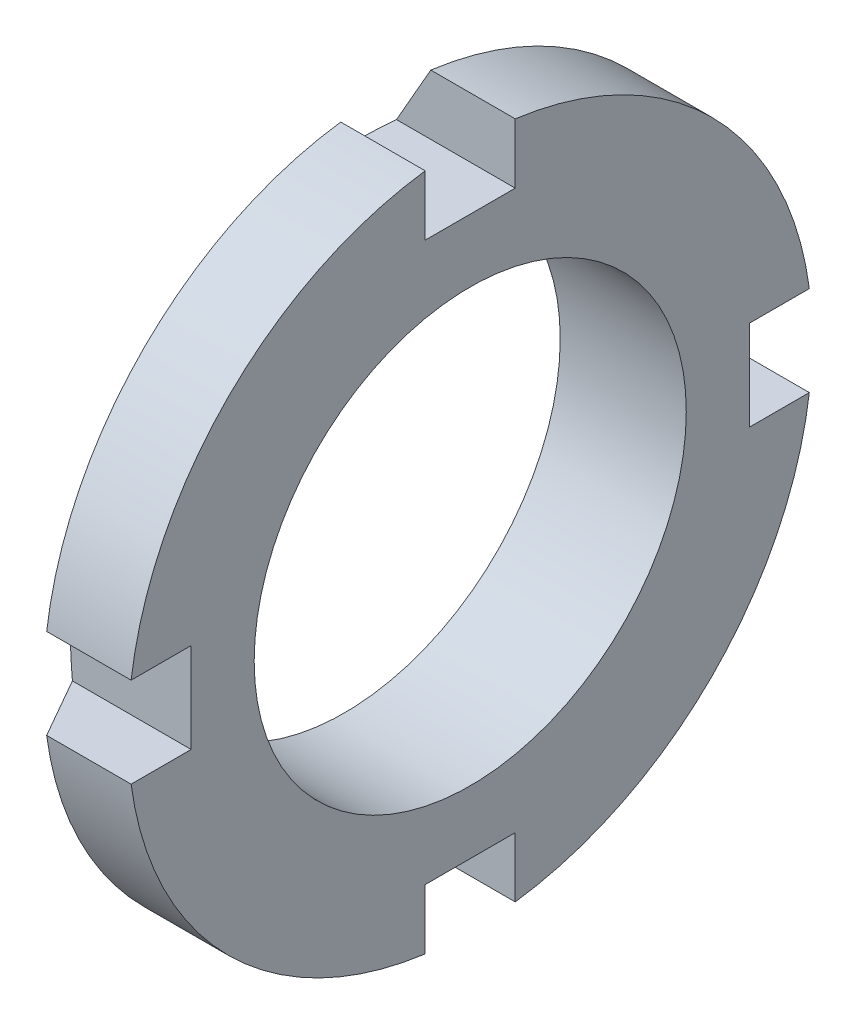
from build123d import *

# Parameters (mm, degrees)
ESQUISSE2_W                  = 5
ESQUISSE2_H                  = 5
ENL_V_MAT_EXTRU_1_DEPTH      = 28.766886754
R_P_TITION_CIRCULAIRE1_COUNT = 4
R_P_TITION_CIRCULAIRE1_ANGLE = 270


with BuildPart() as part:
    # Esquisse1 → Base-R_volution (revolve)
    with BuildSketch(Plane.XY, mode=Mode.PRIVATE) as base_r_volution_sk:
        Polygon((0, 12), (7, 12), (7, 19), (2.309401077, 19), (0, 15), align=None)
    revolve(base_r_volution_sk.sketch.rotate(Axis((-3.572989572, 0, 0), (1, 0, 0)), 262.439157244), axis=Axis((-3.572989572, 0, 0), (1, 0, 0)))

    # Esquisse2 → Enl_v. mat.-Extru.1 (cut, through all)
    with BuildSketch(Plane.ZY):
        with Locations((0, 18)):
            Rectangle(ESQUISSE2_W, ESQUISSE2_H)
    enl_v_mat_extru_1 = extrude(amount=-ENL_V_MAT_EXTRU_1_DEPTH, mode=Mode.SUBTRACT)

    # R_p_tition circulaire1: Enl_v. mat.-Extru.1 ×4 about axis
    r_p_tition_circulaire1_axis = Axis((-3.572989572, 0, 0), (1, 0, 0))
    for i in range(1, R_P_TITION_CIRCULAIRE1_COUNT):
        add(enl_v_mat_extru_1.rotate(r_p_tition_circulaire1_axis, i * R_P_TITION_CIRCULAIRE1_ANGLE / (R_P_TITION_CIRCULAIRE1_COUNT - 1)), mode=Mode.SUBTRACT)


solid = part.part
